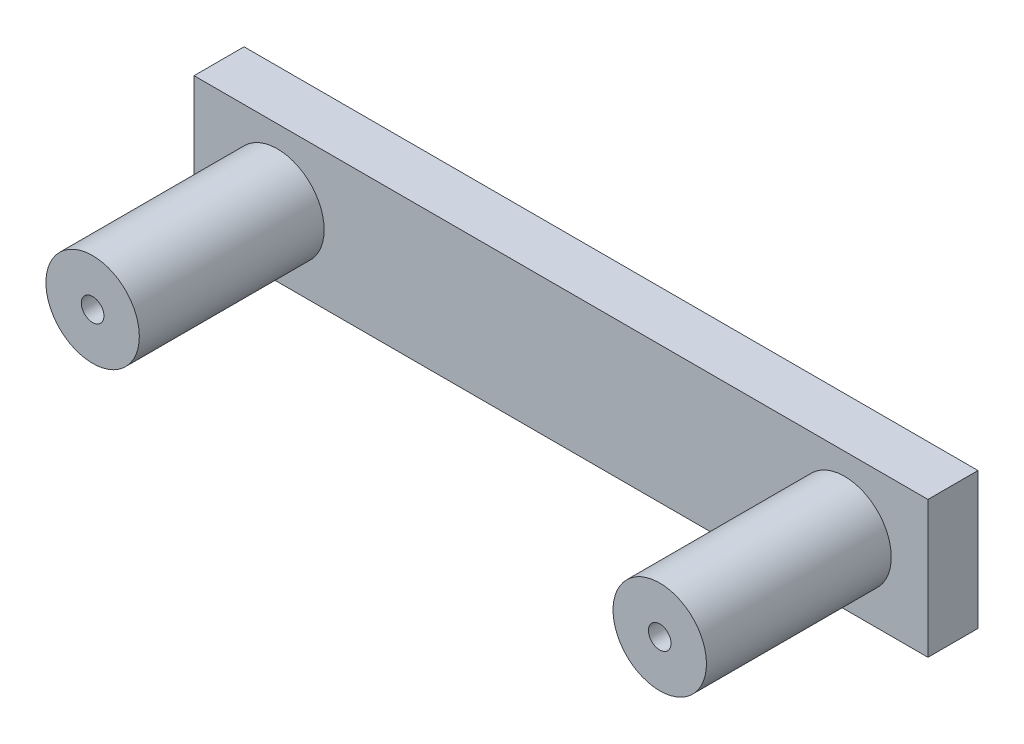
from build123d import *

# Parameters (mm, degrees)
SKETCH1_W                                      = 139.7
SKETCH1_H                                      = 26.035
BOSS_EXTRUDE1_DEPTH                            = 9.525
SKETCH2_R                                      = 8.89
BOSS_EXTRUDE2_DEPTH                            = 35.179
CBORE_FOR_8_SOCKET_HEAD_CAP_SCREW1_D           = 4.3053
CBORE_FOR_8_SOCKET_HEAD_CAP_SCREW1_CBORE_D     = 7.9375
CBORE_FOR_8_SOCKET_HEAD_CAP_SCREW1_CBORE_DEPTH = 6.35


with BuildPart() as part:
    # Sketch1 → Boss-Extrude1 (new body)
    with BuildSketch(Plane.XY):
        Rectangle(SKETCH1_W, SKETCH1_H)
    extrude(amount=BOSS_EXTRUDE1_DEPTH)

    # Sketch2 → Boss-Extrude2 (add)
    with BuildSketch(Plane.XY.offset(9.525)):
        with Locations((-53.975, 0)):
            Circle(SKETCH2_R)
        with Locations((53.975, 0)):
            Circle(SKETCH2_R)
    extrude(amount=BOSS_EXTRUDE2_DEPTH)

    # CBORE for _8 Socket Head Cap Screw1 (through all)
    with Locations(Plane(origin=(0, 0, 0), x_dir=(-1, 0, 0), z_dir=(0, 0, -1))):
        with Locations((53.975, 0), (-53.975, 0)):
            CounterBoreHole(CBORE_FOR_8_SOCKET_HEAD_CAP_SCREW1_D / 2, CBORE_FOR_8_SOCKET_HEAD_CAP_SCREW1_CBORE_D / 2, CBORE_FOR_8_SOCKET_HEAD_CAP_SCREW1_CBORE_DEPTH)


solid = part.part
